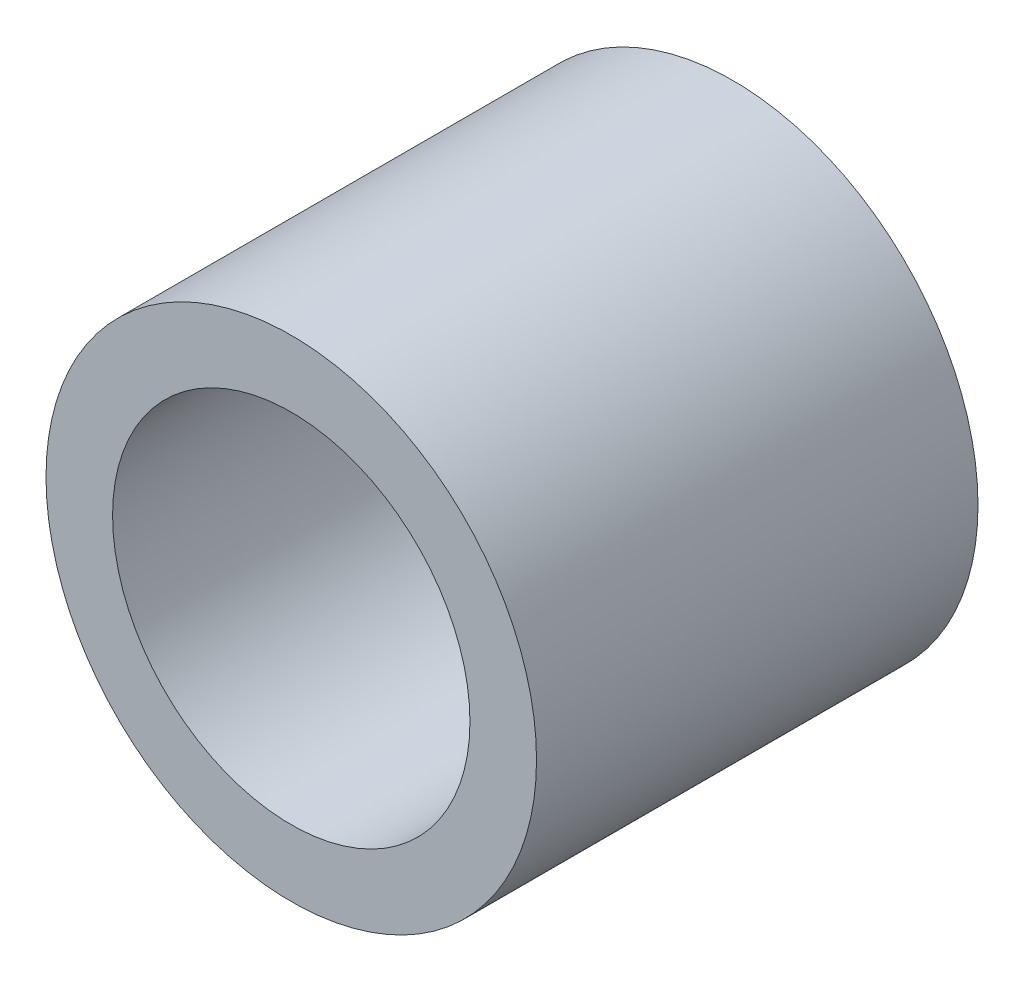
ISO-10303-21;
HEADER;
FILE_DESCRIPTION(('STEP AP214'),'2;1');
FILE_NAME('part.step','',(''),(''),'','','');
FILE_SCHEMA(('AUTOMOTIVE_DESIGN { 1 0 10303 214 1 1 1 1 }'));
ENDSEC;
DATA;
#1=APPLICATION_CONTEXT('core data for automotive mechanical design processes');
#2=APPLICATION_PROTOCOL_DEFINITION('international standard','automotive_design',2000,#1);
#3=PRODUCT_CONTEXT('',#1,'mechanical');
#4=PRODUCT('Part','Part','',(#3));
#5=PRODUCT_RELATED_PRODUCT_CATEGORY('part','',(#4));
#6=PRODUCT_DEFINITION_FORMATION('','',#4);
#7=PRODUCT_DEFINITION_CONTEXT('part definition',#1,'design');
#8=PRODUCT_DEFINITION('design','',#6,#7);
#9=PRODUCT_DEFINITION_SHAPE('','',#8);
#10=(LENGTH_UNIT() NAMED_UNIT(*) SI_UNIT(.MILLI.,.METRE.));
#11=(NAMED_UNIT(*) PLANE_ANGLE_UNIT() SI_UNIT($,.RADIAN.));
#12=(NAMED_UNIT(*) SI_UNIT($,.STERADIAN.) SOLID_ANGLE_UNIT());
#13=UNCERTAINTY_MEASURE_WITH_UNIT(LENGTH_MEASURE(1.E-05),#10,'distance_accuracy_value','');
#14=(GEOMETRIC_REPRESENTATION_CONTEXT(3) GLOBAL_UNCERTAINTY_ASSIGNED_CONTEXT((#13)) GLOBAL_UNIT_ASSIGNED_CONTEXT((#10,
#11,#12)) REPRESENTATION_CONTEXT('',''));
#15=CARTESIAN_POINT('',(0.,0.,0.));
#16=DIRECTION('',(0.,0.,1.));
#17=DIRECTION('',(1.,0.,0.));
#18=AXIS2_PLACEMENT_3D('',#15,#16,#17);
#19=CARTESIAN_POINT('',(-2.22044604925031E-13,0.,15.75));
#20=DIRECTION('',(0.,0.,0.999999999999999));
#21=DIRECTION('',(1.,0.,0.));
#22=AXIS2_PLACEMENT_3D('',#19,#20,#21);
#23=PLANE('',#22);
#24=CARTESIAN_POINT('',(-2.22044604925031E-13,0.,15.75));
#25=DIRECTION('',(0.,0.,0.999999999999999));
#26=DIRECTION('',(1.,0.,0.));
#27=AXIS2_PLACEMENT_3D('',#24,#25,#26);
#28=CIRCLE('',#27,17.5);
#29=CARTESIAN_POINT('',(-17.5000000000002,0.,15.75));
#30=VERTEX_POINT('',#29);
#31=EDGE_CURVE('E10',#30,#30,#28,.T.);
#32=ORIENTED_EDGE('',*,*,#31,.T.);
#33=EDGE_LOOP('',(#32));
#34=FACE_BOUND('',#33,.T.);
#35=CARTESIAN_POINT('',(-2.22044604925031E-13,0.,15.75));
#36=DIRECTION('',(0.,0.,0.999999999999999));
#37=DIRECTION('',(1.,0.,0.));
#38=AXIS2_PLACEMENT_3D('',#35,#36,#37);
#39=CIRCLE('',#38,12.75);
#40=CARTESIAN_POINT('',(-12.7500000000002,0.,15.75));
#41=VERTEX_POINT('',#40);
#42=EDGE_CURVE('E55',#41,#41,#39,.T.);
#43=ORIENTED_EDGE('',*,*,#42,.F.);
#44=EDGE_LOOP('',(#43));
#45=FACE_BOUND('',#44,.T.);
#46=ADVANCED_FACE('F40',(#34,#45),#23,.T.);
#47=CARTESIAN_POINT('',(-2.22044604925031E-13,-2.22044604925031E-13,-15.75));
#48=DIRECTION('',(0.,0.,0.999999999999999));
#49=DIRECTION('',(1.,0.,0.));
#50=AXIS2_PLACEMENT_3D('',#47,#48,#49);
#51=PLANE('',#50);
#52=CARTESIAN_POINT('',(-2.22044604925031E-13,-2.22044604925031E-13,-15.75));
#53=DIRECTION('',(0.,0.,0.999999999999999));
#54=DIRECTION('',(1.,0.,0.));
#55=AXIS2_PLACEMENT_3D('',#52,#53,#54);
#56=CIRCLE('',#55,17.5);
#57=CARTESIAN_POINT('',(-17.5000000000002,0.,-15.75));
#58=VERTEX_POINT('',#57);
#59=EDGE_CURVE('E44',#58,#58,#56,.T.);
#60=ORIENTED_EDGE('',*,*,#59,.F.);
#61=EDGE_LOOP('',(#60));
#62=FACE_BOUND('',#61,.T.);
#63=CARTESIAN_POINT('',(-2.22044604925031E-13,-2.22044604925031E-13,-15.75));
#64=DIRECTION('',(0.,0.,0.999999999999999));
#65=DIRECTION('',(1.,0.,0.));
#66=AXIS2_PLACEMENT_3D('',#63,#64,#65);
#67=CIRCLE('',#66,12.75);
#68=CARTESIAN_POINT('',(-12.7500000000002,0.,-15.75));
#69=VERTEX_POINT('',#68);
#70=EDGE_CURVE('E57',#69,#69,#67,.T.);
#71=ORIENTED_EDGE('',*,*,#70,.T.);
#72=EDGE_LOOP('',(#71));
#73=FACE_BOUND('',#72,.T.);
#74=ADVANCED_FACE('F67',(#62,#73),#51,.F.);
#75=CARTESIAN_POINT('',(-2.22044604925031E-13,0.,15.75));
#76=DIRECTION('',(0.,0.,-0.999999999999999));
#77=DIRECTION('',(-1.,0.,0.));
#78=AXIS2_PLACEMENT_3D('',#75,#76,#77);
#79=CYLINDRICAL_SURFACE('',#78,17.5);
#80=CARTESIAN_POINT('',(-17.5000000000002,0.,15.75));
#81=CARTESIAN_POINT('',(-17.5000000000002,0.,15.421875));
#82=CARTESIAN_POINT('',(-17.5000000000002,0.,15.09375));
#83=CARTESIAN_POINT('',(-17.5000000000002,0.,14.4375));
#84=CARTESIAN_POINT('',(-17.5000000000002,0.,14.109375));
#85=CARTESIAN_POINT('',(-17.5000000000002,0.,13.453125));
#86=CARTESIAN_POINT('',(-17.5000000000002,0.,13.125));
#87=CARTESIAN_POINT('',(-17.5000000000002,0.,12.46875));
#88=CARTESIAN_POINT('',(-17.5000000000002,0.,12.140625));
#89=CARTESIAN_POINT('',(-17.5000000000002,0.,11.484375));
#90=CARTESIAN_POINT('',(-17.5000000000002,0.,11.15625));
#91=CARTESIAN_POINT('',(-17.5000000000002,0.,10.5));
#92=CARTESIAN_POINT('',(-17.5000000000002,0.,10.171875));
#93=CARTESIAN_POINT('',(-17.5000000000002,0.,9.51562499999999));
#94=CARTESIAN_POINT('',(-17.5000000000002,0.,9.18749999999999));
#95=CARTESIAN_POINT('',(-17.5000000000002,0.,8.53124999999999));
#96=CARTESIAN_POINT('',(-17.5000000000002,0.,8.20312499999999));
#97=CARTESIAN_POINT('',(-17.5000000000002,0.,7.546875));
#98=CARTESIAN_POINT('',(-17.5000000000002,0.,7.21875));
#99=CARTESIAN_POINT('',(-17.5000000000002,0.,6.5625));
#100=CARTESIAN_POINT('',(-17.5000000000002,0.,6.234375));
#101=CARTESIAN_POINT('',(-17.5000000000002,0.,5.578125));
#102=CARTESIAN_POINT('',(-17.5000000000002,0.,5.25));
#103=CARTESIAN_POINT('',(-17.5000000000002,0.,4.59375));
#104=CARTESIAN_POINT('',(-17.5000000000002,0.,4.265625));
#105=CARTESIAN_POINT('',(-17.5000000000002,0.,3.609375));
#106=CARTESIAN_POINT('',(-17.5000000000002,0.,3.28125));
#107=CARTESIAN_POINT('',(-17.5000000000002,0.,2.625));
#108=CARTESIAN_POINT('',(-17.5000000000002,0.,2.296875));
#109=CARTESIAN_POINT('',(-17.5000000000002,0.,1.640625));
#110=CARTESIAN_POINT('',(-17.5000000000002,0.,1.3125));
#111=CARTESIAN_POINT('',(-17.5000000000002,0.,0.656250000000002));
#112=CARTESIAN_POINT('',(-17.5000000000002,0.,0.328125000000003));
#113=CARTESIAN_POINT('',(-17.5000000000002,0.,-0.328124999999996));
#114=CARTESIAN_POINT('',(-17.5000000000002,0.,-0.656249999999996));
#115=CARTESIAN_POINT('',(-17.5000000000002,0.,-1.31249999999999));
#116=CARTESIAN_POINT('',(-17.5000000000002,0.,-1.64062499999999));
#117=CARTESIAN_POINT('',(-17.5000000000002,0.,-2.29687499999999));
#118=CARTESIAN_POINT('',(-17.5000000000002,0.,-2.62499999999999));
#119=CARTESIAN_POINT('',(-17.5000000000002,0.,-3.28124999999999));
#120=CARTESIAN_POINT('',(-17.5000000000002,0.,-3.60937499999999));
#121=CARTESIAN_POINT('',(-17.5000000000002,0.,-4.26562499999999));
#122=CARTESIAN_POINT('',(-17.5000000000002,0.,-4.59374999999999));
#123=CARTESIAN_POINT('',(-17.5000000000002,0.,-5.24999999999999));
#124=CARTESIAN_POINT('',(-17.5000000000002,0.,-5.57812499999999));
#125=CARTESIAN_POINT('',(-17.5000000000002,0.,-6.23437499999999));
#126=CARTESIAN_POINT('',(-17.5000000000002,0.,-6.56249999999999));
#127=CARTESIAN_POINT('',(-17.5000000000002,0.,-7.21874999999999));
#128=CARTESIAN_POINT('',(-17.5000000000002,0.,-7.54687499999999));
#129=CARTESIAN_POINT('',(-17.5000000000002,0.,-8.20312499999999));
#130=CARTESIAN_POINT('',(-17.5000000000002,0.,-8.53124999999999));
#131=CARTESIAN_POINT('',(-17.5000000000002,0.,-9.18749999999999));
#132=CARTESIAN_POINT('',(-17.5000000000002,0.,-9.51562499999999));
#133=CARTESIAN_POINT('',(-17.5000000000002,0.,-10.171875));
#134=CARTESIAN_POINT('',(-17.5000000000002,0.,-10.5));
#135=CARTESIAN_POINT('',(-17.5000000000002,0.,-11.15625));
#136=CARTESIAN_POINT('',(-17.5000000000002,0.,-11.484375));
#137=CARTESIAN_POINT('',(-17.5000000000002,0.,-12.140625));
#138=CARTESIAN_POINT('',(-17.5000000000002,0.,-12.46875));
#139=CARTESIAN_POINT('',(-17.5000000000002,0.,-13.125));
#140=CARTESIAN_POINT('',(-17.5000000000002,0.,-13.453125));
#141=CARTESIAN_POINT('',(-17.5000000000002,0.,-14.109375));
#142=CARTESIAN_POINT('',(-17.5000000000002,0.,-14.4375));
#143=CARTESIAN_POINT('',(-17.5000000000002,0.,-15.09375));
#144=CARTESIAN_POINT('',(-17.5000000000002,0.,-15.421875));
#145=CARTESIAN_POINT('',(-17.5000000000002,0.,-15.75));
#146=B_SPLINE_CURVE_WITH_KNOTS('',3,(#80,#81,#82,#83,#84,#85,#86,#87,#88,#89,#90,#91,#92,#93,
#94,#95,#96,#97,#98,#99,#100,#101,#102,#103,#104,#105,#106,#107,#108,#109,#110,#111,#112,#113,
#114,#115,#116,#117,#118,#119,#120,#121,#122,#123,#124,#125,#126,#127,#128,#129,#130,#131,#132,
#133,#134,#135,#136,#137,#138,#139,#140,#141,#142,#143,#144,#145),.UNSPECIFIED.,.F.,.F.,(4,2,2,
2,2,2,2,2,2,2,2,2,2,2,2,2,2,2,2,2,2,2,2,2,2,2,2,2,2,2,2,2,4),(0.,0.984375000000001,1.96875,
2.953125,3.9375,4.921875,5.90625,6.890625,7.87499999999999,8.85937499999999,9.84374999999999,
10.828125,11.8125,12.796875,13.78125,14.765625,15.75,16.734375,17.71875,18.703125,19.6875,
20.671875,21.65625,22.640625,23.625,24.609375,25.59375,26.578125,27.5625,28.546875,29.53125,
30.515625,31.5),.UNSPECIFIED.);
#147=EDGE_CURVE('BSEAM42',#30,#58,#146,.T.);
#148=ORIENTED_EDGE('',*,*,#31,.F.);
#149=ORIENTED_EDGE('',*,*,#59,.T.);
#150=ORIENTED_EDGE('',*,*,#147,.T.);
#151=ORIENTED_EDGE('',*,*,#147,.F.);
#152=EDGE_LOOP('',(#148,#150,#149,#151));
#153=FACE_BOUND('',#152,.T.);
#154=ADVANCED_FACE('F42',(#153),#79,.T.);
#155=CARTESIAN_POINT('',(-2.22044604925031E-13,0.,15.75));
#156=DIRECTION('',(0.,0.,-0.999999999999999));
#157=DIRECTION('',(-1.,0.,0.));
#158=AXIS2_PLACEMENT_3D('',#155,#156,#157);
#159=CYLINDRICAL_SURFACE('',#158,12.75);
#160=CARTESIAN_POINT('',(-12.7500000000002,0.,15.75));
#161=CARTESIAN_POINT('',(-12.7500000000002,0.,15.421875));
#162=CARTESIAN_POINT('',(-12.7500000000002,0.,15.09375));
#163=CARTESIAN_POINT('',(-12.7500000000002,0.,14.4375));
#164=CARTESIAN_POINT('',(-12.7500000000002,0.,14.109375));
#165=CARTESIAN_POINT('',(-12.7500000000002,0.,13.453125));
#166=CARTESIAN_POINT('',(-12.7500000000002,0.,13.125));
#167=CARTESIAN_POINT('',(-12.7500000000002,0.,12.46875));
#168=CARTESIAN_POINT('',(-12.7500000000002,0.,12.140625));
#169=CARTESIAN_POINT('',(-12.7500000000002,0.,11.484375));
#170=CARTESIAN_POINT('',(-12.7500000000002,0.,11.15625));
#171=CARTESIAN_POINT('',(-12.7500000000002,0.,10.5));
#172=CARTESIAN_POINT('',(-12.7500000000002,0.,10.171875));
#173=CARTESIAN_POINT('',(-12.7500000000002,0.,9.51562499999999));
#174=CARTESIAN_POINT('',(-12.7500000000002,0.,9.18749999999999));
#175=CARTESIAN_POINT('',(-12.7500000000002,0.,8.53124999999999));
#176=CARTESIAN_POINT('',(-12.7500000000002,0.,8.20312499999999));
#177=CARTESIAN_POINT('',(-12.7500000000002,0.,7.546875));
#178=CARTESIAN_POINT('',(-12.7500000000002,0.,7.21875));
#179=CARTESIAN_POINT('',(-12.7500000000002,0.,6.5625));
#180=CARTESIAN_POINT('',(-12.7500000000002,0.,6.234375));
#181=CARTESIAN_POINT('',(-12.7500000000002,0.,5.578125));
#182=CARTESIAN_POINT('',(-12.7500000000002,0.,5.25));
#183=CARTESIAN_POINT('',(-12.7500000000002,0.,4.59375));
#184=CARTESIAN_POINT('',(-12.7500000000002,0.,4.265625));
#185=CARTESIAN_POINT('',(-12.7500000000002,0.,3.609375));
#186=CARTESIAN_POINT('',(-12.7500000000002,0.,3.28125));
#187=CARTESIAN_POINT('',(-12.7500000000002,0.,2.625));
#188=CARTESIAN_POINT('',(-12.7500000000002,0.,2.296875));
#189=CARTESIAN_POINT('',(-12.7500000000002,0.,1.640625));
#190=CARTESIAN_POINT('',(-12.7500000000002,0.,1.3125));
#191=CARTESIAN_POINT('',(-12.7500000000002,0.,0.656250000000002));
#192=CARTESIAN_POINT('',(-12.7500000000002,0.,0.328125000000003));
#193=CARTESIAN_POINT('',(-12.7500000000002,0.,-0.328124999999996));
#194=CARTESIAN_POINT('',(-12.7500000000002,0.,-0.656249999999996));
#195=CARTESIAN_POINT('',(-12.7500000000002,0.,-1.31249999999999));
#196=CARTESIAN_POINT('',(-12.7500000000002,0.,-1.64062499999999));
#197=CARTESIAN_POINT('',(-12.7500000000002,0.,-2.29687499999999));
#198=CARTESIAN_POINT('',(-12.7500000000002,0.,-2.62499999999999));
#199=CARTESIAN_POINT('',(-12.7500000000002,0.,-3.28124999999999));
#200=CARTESIAN_POINT('',(-12.7500000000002,0.,-3.60937499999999));
#201=CARTESIAN_POINT('',(-12.7500000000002,0.,-4.26562499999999));
#202=CARTESIAN_POINT('',(-12.7500000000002,0.,-4.59374999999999));
#203=CARTESIAN_POINT('',(-12.7500000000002,0.,-5.24999999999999));
#204=CARTESIAN_POINT('',(-12.7500000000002,0.,-5.57812499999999));
#205=CARTESIAN_POINT('',(-12.7500000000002,0.,-6.23437499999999));
#206=CARTESIAN_POINT('',(-12.7500000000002,0.,-6.56249999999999));
#207=CARTESIAN_POINT('',(-12.7500000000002,0.,-7.21874999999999));
#208=CARTESIAN_POINT('',(-12.7500000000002,0.,-7.54687499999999));
#209=CARTESIAN_POINT('',(-12.7500000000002,0.,-8.20312499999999));
#210=CARTESIAN_POINT('',(-12.7500000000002,0.,-8.53124999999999));
#211=CARTESIAN_POINT('',(-12.7500000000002,0.,-9.18749999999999));
#212=CARTESIAN_POINT('',(-12.7500000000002,0.,-9.51562499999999));
#213=CARTESIAN_POINT('',(-12.7500000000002,0.,-10.171875));
#214=CARTESIAN_POINT('',(-12.7500000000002,0.,-10.5));
#215=CARTESIAN_POINT('',(-12.7500000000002,0.,-11.15625));
#216=CARTESIAN_POINT('',(-12.7500000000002,0.,-11.484375));
#217=CARTESIAN_POINT('',(-12.7500000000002,0.,-12.140625));
#218=CARTESIAN_POINT('',(-12.7500000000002,0.,-12.46875));
#219=CARTESIAN_POINT('',(-12.7500000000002,0.,-13.125));
#220=CARTESIAN_POINT('',(-12.7500000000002,0.,-13.453125));
#221=CARTESIAN_POINT('',(-12.7500000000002,0.,-14.109375));
#222=CARTESIAN_POINT('',(-12.7500000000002,0.,-14.4375));
#223=CARTESIAN_POINT('',(-12.7500000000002,0.,-15.09375));
#224=CARTESIAN_POINT('',(-12.7500000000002,0.,-15.421875));
#225=CARTESIAN_POINT('',(-12.7500000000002,0.,-15.75));
#226=B_SPLINE_CURVE_WITH_KNOTS('',3,(#160,#161,#162,#163,#164,#165,#166,#167,#168,#169,#170,
#171,#172,#173,#174,#175,#176,#177,#178,#179,#180,#181,#182,#183,#184,#185,#186,#187,#188,#189,
#190,#191,#192,#193,#194,#195,#196,#197,#198,#199,#200,#201,#202,#203,#204,#205,#206,#207,#208,
#209,#210,#211,#212,#213,#214,#215,#216,#217,#218,#219,#220,#221,#222,#223,#224,#225),
.UNSPECIFIED.,.F.,.F.,(4,2,2,2,2,2,2,2,2,2,2,2,2,2,2,2,2,2,2,2,2,2,2,2,2,2,2,2,2,2,2,2,4),(0.,
0.984375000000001,1.96875,2.953125,3.9375,4.921875,5.90625,6.890625,7.87499999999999,
8.85937499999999,9.84374999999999,10.828125,11.8125,12.796875,13.78125,14.765625,15.75,
16.734375,17.71875,18.703125,19.6875,20.671875,21.65625,22.640625,23.625,24.609375,25.59375,
26.578125,27.5625,28.546875,29.53125,30.515625,31.5),.UNSPECIFIED.);
#227=EDGE_CURVE('BSEAM63',#41,#69,#226,.T.);
#228=ORIENTED_EDGE('',*,*,#42,.T.);
#229=ORIENTED_EDGE('',*,*,#70,.F.);
#230=ORIENTED_EDGE('',*,*,#227,.T.);
#231=ORIENTED_EDGE('',*,*,#227,.F.);
#232=EDGE_LOOP('',(#228,#230,#229,#231));
#233=FACE_BOUND('',#232,.T.);
#234=ADVANCED_FACE('F63',(#233),#159,.F.);
#235=CLOSED_SHELL('',(#46,#74,#154,#234));
#236=MANIFOLD_SOLID_BREP('B2',#235);
#237=ADVANCED_BREP_SHAPE_REPRESENTATION('',(#18,#236),#14);
#238=SHAPE_DEFINITION_REPRESENTATION(#9,#237);
ENDSEC;
END-ISO-10303-21;
